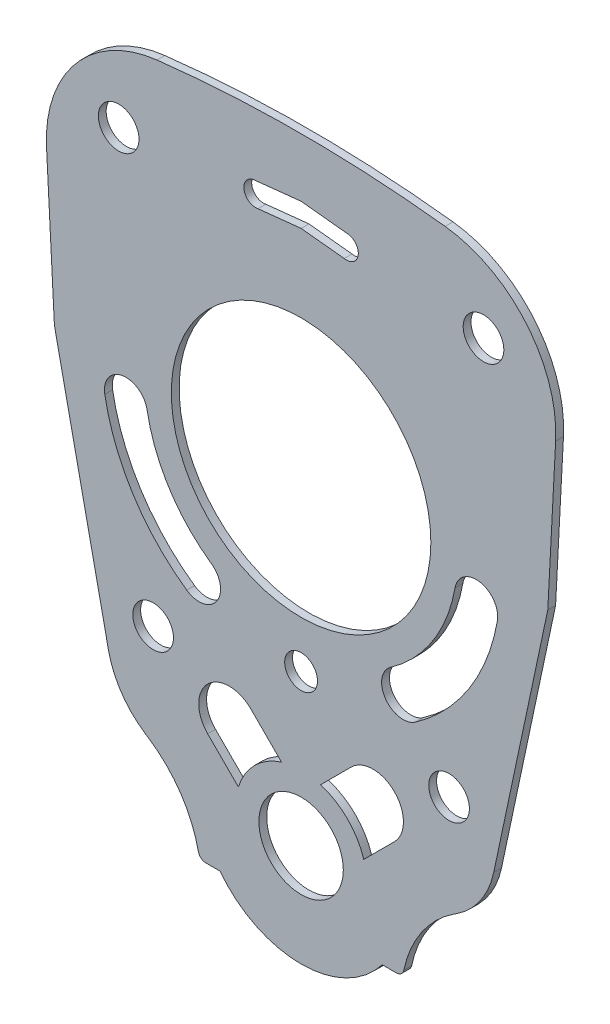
from build123d import *

# Parameters (mm, degrees)
BASE_EXTRUSION_DEPTH    = 1
ESQUISSE3_R             = 2.6
ESQUISSE3_R_2           = 16.6
ESQUISSE3_R_3           = 2.1
ESQUISSE3_R_4           = 5.4
ENL_V_MAT_EXTRU_5_DEPTH = 2


with BuildPart() as part:
    # Esquisse2 → Base-Extrusion (new body)
    with BuildSketch(Plane.XY):
        with BuildLine():
            Line((-12.167354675, -49.89), (-10.381228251, -49.89))
            ThreePointArc((-10.381228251, -49.89), (0, -55), (10.381228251, -49.89))
            Line((10.381228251, -49.89), (12.167354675, -49.89))
            ThreePointArc((12.167354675, -49.89), (12.79701084, -49.666873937), (13.145681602, -49.097066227))
            ThreePointArc((13.145681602, -49.097066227), (15.404087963, -43.786968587), (19.5, -39.722360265))
            Line((19.5, -39.722360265), (19.870791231, -39.481565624))
            ThreePointArc((19.870791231, -39.481565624), (22.945149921, -36.486657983), (24.639385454, -32.543217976))
            Line((24.639385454, -32.543217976), (31.556659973, 0))
            Line((31.556659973, 0), (32.563117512, 19.20435387))
            ThreePointArc((32.563117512, 19.20435387), (28.807012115, 30.367595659), (18.427827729, 35.935254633))
            ThreePointArc((18.427827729, 35.935254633), (0, 37), (-18.427827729, 35.935254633))
            ThreePointArc((-18.427827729, 35.935254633), (-28.807012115, 30.367595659), (-32.563117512, 19.20435387))
            Line((-32.563117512, 19.20435387), (-31.556659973, 0))
            Line((-31.556659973, 0), (-24.639385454, -32.543217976))
            ThreePointArc((-24.639385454, -32.543217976), (-22.945149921, -36.486657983), (-19.870791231, -39.481565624))
            Line((-19.870791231, -39.481565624), (-19.5, -39.722360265))
            ThreePointArc((-19.5, -39.722360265), (-15.404087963, -43.786968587), (-13.145681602, -49.097066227))
            ThreePointArc((-13.145681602, -49.097066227), (-12.79701084, -49.666873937), (-12.167354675, -49.89))
        make_face()
    extrude(amount=BASE_EXTRUSION_DEPTH)

    # Esquisse3 → Enl_v. mat.-Extru.5 (cut)
    with BuildSketch(Plane.XY):
        with Locations((-23.334523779, 26)):
            Circle(ESQUISSE3_R)
        Circle(ESQUISSE3_R_2)
        with Locations((0, -22.6)):
            Circle(ESQUISSE3_R_3)
        with Locations((-18.9280224, -27.032017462)):
            Circle(ESQUISSE3_R)
        with Locations((0, -41.9)):
            Circle(ESQUISSE3_R_4)
        with Locations((18.9280224, -27.032017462)):
            Circle(ESQUISSE3_R)
        with Locations((23.334523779, 26)):
            Circle(ESQUISSE3_R)
        with BuildLine():
            Line((-6.434671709, -29.949895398), (-2.502986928, -33.881580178))
            ThreePointArc((-2.502986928, -33.881580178), (-5.939696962, -35.960303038), (-8.018419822, -39.397013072))
            Line((-8.018419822, -39.397013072), (-11.950104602, -35.465328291))
            ThreePointArc((-11.950104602, -35.465328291), (-11.950104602, -29.949895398), (-6.434671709, -29.949895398))
        make_face()
        with BuildLine():
            Line((0, 29.5), (-5.821527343, 28.888132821))
            ThreePointArc((-5.821527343, 28.888132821), (-7.313310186, 27.231340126), (-5.509659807, 25.920911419))
            Line((-5.509659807, 25.920911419), (0, 26.5))
            Line((0, 26.5), (5.509659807, 25.920911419))
            ThreePointArc((5.509659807, 25.920911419), (7.313310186, 27.231340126), (5.821527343, 28.888132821))
            Line((5.821527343, 28.888132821), (0, 29.5))
        make_face()
        with BuildLine():
            Line((11.950104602, -35.465328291), (8.018419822, -39.397013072))
            ThreePointArc((8.018419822, -39.397013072), (5.939696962, -35.960303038), (2.502986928, -33.881580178))
            Line((2.502986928, -33.881580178), (6.434671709, -29.949895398))
            ThreePointArc((6.434671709, -29.949895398), (11.950104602, -29.949895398), (11.950104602, -35.465328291))
        make_face()
        with BuildLine():
            ThreePointArc((-14.626199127, -20.888377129), (-10.796195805, -20.213044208), (-11.471528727, -16.383040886))
            ThreePointArc((-11.471528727, -16.383040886), (-16.867828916, -10.745992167), (-19.69615506, -3.472963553))
            ThreePointArc((-19.69615506, -3.472963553), (-22.88190887, -1.242274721), (-25.112597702, -4.428028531))
            ThreePointArc((-25.112597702, -4.428028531), (-21.506481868, -13.701140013), (-14.626199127, -20.888377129))
        make_face()
        with BuildLine():
            ThreePointArc((14.626199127, -20.888377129), (10.796195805, -20.213044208), (11.471528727, -16.383040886))
            ThreePointArc((11.471528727, -16.383040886), (16.867828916, -10.745992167), (19.69615506, -3.472963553))
            ThreePointArc((19.69615506, -3.472963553), (22.88190887, -1.242274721), (25.112597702, -4.428028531))
            ThreePointArc((25.112597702, -4.428028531), (21.506481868, -13.701140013), (14.626199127, -20.888377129))
        make_face()
    extrude(amount=ENL_V_MAT_EXTRU_5_DEPTH, mode=Mode.SUBTRACT)


solid = part.part
